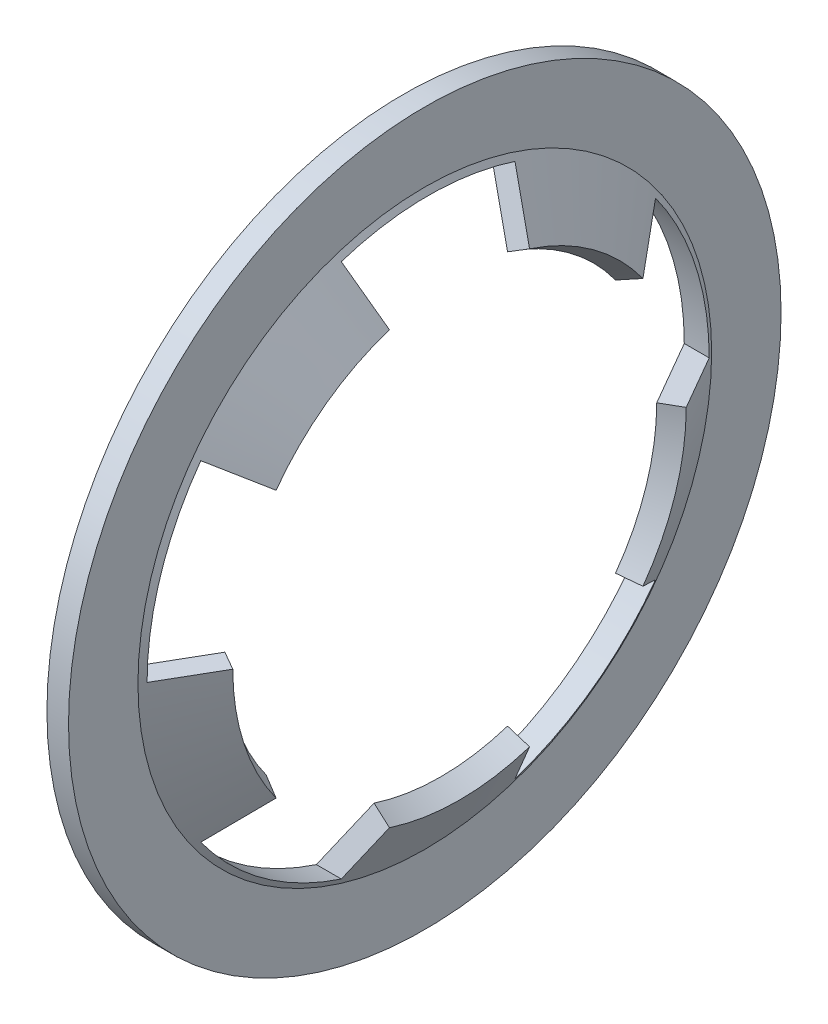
ISO-10303-21;
HEADER;
FILE_DESCRIPTION(('STEP AP214'),'2;1');
FILE_NAME('part.step','',(''),(''),'','','');
FILE_SCHEMA(('AUTOMOTIVE_DESIGN { 1 0 10303 214 1 1 1 1 }'));
ENDSEC;
DATA;
#1=APPLICATION_CONTEXT('core data for automotive mechanical design processes');
#2=APPLICATION_PROTOCOL_DEFINITION('international standard','automotive_design',2000,#1);
#3=PRODUCT_CONTEXT('',#1,'mechanical');
#4=PRODUCT('Part','Part','',(#3));
#5=PRODUCT_RELATED_PRODUCT_CATEGORY('part','',(#4));
#6=PRODUCT_DEFINITION_FORMATION('','',#4);
#7=PRODUCT_DEFINITION_CONTEXT('part definition',#1,'design');
#8=PRODUCT_DEFINITION('design','',#6,#7);
#9=PRODUCT_DEFINITION_SHAPE('','',#8);
#10=(LENGTH_UNIT() NAMED_UNIT(*) SI_UNIT(.MILLI.,.METRE.));
#11=(NAMED_UNIT(*) PLANE_ANGLE_UNIT() SI_UNIT($,.RADIAN.));
#12=(NAMED_UNIT(*) SI_UNIT($,.STERADIAN.) SOLID_ANGLE_UNIT());
#13=UNCERTAINTY_MEASURE_WITH_UNIT(LENGTH_MEASURE(1.E-05),#10,'distance_accuracy_value','');
#14=(GEOMETRIC_REPRESENTATION_CONTEXT(3) GLOBAL_UNCERTAINTY_ASSIGNED_CONTEXT((#13)) GLOBAL_UNIT_ASSIGNED_CONTEXT((#10,
#11,#12)) REPRESENTATION_CONTEXT('',''));
#15=CARTESIAN_POINT('',(0.,0.,0.));
#16=DIRECTION('',(0.,0.,1.));
#17=DIRECTION('',(1.,0.,0.));
#18=AXIS2_PLACEMENT_3D('',#15,#16,#17);
#19=CARTESIAN_POINT('',(1.04307806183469,0.,0.));
#20=DIRECTION('',(-0.999999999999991,0.,0.));
#21=DIRECTION('',(0.,0.,1.));
#22=AXIS2_PLACEMENT_3D('',#19,#20,#21);
#23=CONICAL_SURFACE('',#22,4.2,1.0471975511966);
#24=CARTESIAN_POINT('',(0.400000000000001,0.,0.));
#25=DIRECTION('',(-0.999999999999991,0.,0.));
#26=DIRECTION('',(0.,0.,1.));
#27=AXIS2_PLACEMENT_3D('',#24,#25,#26);
#28=CIRCLE('',#27,5.31384387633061);
#29=CARTESIAN_POINT('',(0.400000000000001,0.,5.31384387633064));
#30=VERTEX_POINT('',#29);
#31=EDGE_CURVE('E11',#30,#30,#28,.T.);
#32=ORIENTED_EDGE('',*,*,#31,.F.);
#33=EDGE_LOOP('',(#32));
#34=FACE_BOUND('',#33,.T.);
#35=DIRECTION('',(-0.499999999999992,0.82363910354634,-0.267616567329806));
#36=VECTOR('',#35,1.);
#37=CARTESIAN_POINT('',(3.46794919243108,0.,0.));
#38=LINE('',#37,#36);
#39=CARTESIAN_POINT('',(1.04307806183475,3.9944373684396,-1.29787137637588));
#40=VERTEX_POINT('',#39);
#41=CARTESIAN_POINT('',(0.461880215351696,4.95183191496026,-1.60894772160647));
#42=VERTEX_POINT('',#41);
#43=EDGE_CURVE('E344',#40,#42,#38,.T.);
#44=ORIENTED_EDGE('',*,*,#43,.F.);
#45=CARTESIAN_POINT('',(1.04307806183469,0.,0.));
#46=DIRECTION('',(-0.999999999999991,0.,0.));
#47=DIRECTION('',(0.,0.,1.));
#48=AXIS2_PLACEMENT_3D('',#45,#46,#47);
#49=CIRCLE('',#48,4.2);
#50=CARTESIAN_POINT('',(1.04307806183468,2.46869805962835,-3.39787137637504));
#51=VERTEX_POINT('',#50);
#52=EDGE_CURVE('E191',#40,#51,#49,.T.);
#53=ORIENTED_EDGE('',*,*,#52,.T.);
#54=DIRECTION('',(0.499999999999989,-0.509036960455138,0.700629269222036));
#55=VECTOR('',#54,1.);
#56=CARTESIAN_POINT('',(3.46794919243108,0.,0.));
#57=LINE('',#56,#55);
#58=CARTESIAN_POINT('',(0.461880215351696,3.06040043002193,-4.2122798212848));
#59=VERTEX_POINT('',#58);
#60=EDGE_CURVE('E336',#59,#51,#57,.T.);
#61=ORIENTED_EDGE('',*,*,#60,.F.);
#62=CARTESIAN_POINT('',(0.4618802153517,0.,0.));
#63=DIRECTION('',(-0.999999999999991,0.,0.));
#64=DIRECTION('',(0.,0.587785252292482,-0.809016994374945));
#65=AXIS2_PLACEMENT_3D('',#62,#63,#64);
#66=CIRCLE('',#65,5.20666419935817);
#67=CARTESIAN_POINT('',(0.461880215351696,0.,-5.20666419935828));
#68=VERTEX_POINT('',#67);
#69=EDGE_CURVE('E326',#68,#59,#66,.F.);
#70=ORIENTED_EDGE('',*,*,#69,.F.);
#71=DIRECTION('',(-0.49999999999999,0.,-0.866025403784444));
#72=VECTOR('',#71,1.);
#73=CARTESIAN_POINT('',(3.46794919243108,0.,0.));
#74=LINE('',#73,#72);
#75=CARTESIAN_POINT('',(1.04307806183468,0.,-4.19999999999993));
#76=VERTEX_POINT('',#75);
#77=EDGE_CURVE('E318',#76,#68,#74,.T.);
#78=ORIENTED_EDGE('',*,*,#77,.F.);
#79=CARTESIAN_POINT('',(1.04307806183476,-2.4686980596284,-3.39787137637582));
#80=VERTEX_POINT('',#79);
#81=EDGE_CURVE('E193',#76,#80,#49,.T.);
#82=ORIENTED_EDGE('',*,*,#81,.T.);
#83=DIRECTION('',(0.49999999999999,0.509036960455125,0.700629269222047));
#84=VECTOR('',#83,1.);
#85=CARTESIAN_POINT('',(3.46794919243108,0.,0.));
#86=LINE('',#85,#84);
#87=CARTESIAN_POINT('',(0.461880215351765,-3.06040043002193,-4.21227982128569));
#88=VERTEX_POINT('',#87);
#89=EDGE_CURVE('E310',#88,#80,#86,.T.);
#90=ORIENTED_EDGE('',*,*,#89,.F.);
#91=CARTESIAN_POINT('',(0.4618802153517,0.,0.));
#92=DIRECTION('',(-0.999999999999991,0.,0.));
#93=DIRECTION('',(0.,-0.58778525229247,-0.809016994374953));
#94=AXIS2_PLACEMENT_3D('',#91,#92,#93);
#95=CIRCLE('',#94,5.20666419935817);
#96=CARTESIAN_POINT('',(0.461880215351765,-4.95183191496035,-1.60894772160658));
#97=VERTEX_POINT('',#96);
#98=EDGE_CURVE('E300',#97,#88,#95,.F.);
#99=ORIENTED_EDGE('',*,*,#98,.F.);
#100=DIRECTION('',(-0.49999999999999,-0.823639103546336,-0.267616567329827));
#101=VECTOR('',#100,1.);
#102=CARTESIAN_POINT('',(3.46794919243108,0.,0.));
#103=LINE('',#102,#101);
#104=CARTESIAN_POINT('',(1.04307806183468,-3.99443736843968,-1.29787137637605));
#105=VERTEX_POINT('',#104);
#106=EDGE_CURVE('E292',#105,#97,#103,.T.);
#107=ORIENTED_EDGE('',*,*,#106,.F.);
#108=CARTESIAN_POINT('',(1.04307806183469,-3.99443736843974,1.29787137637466));
#109=VERTEX_POINT('',#108);
#110=EDGE_CURVE('E195',#105,#109,#49,.T.);
#111=ORIENTED_EDGE('',*,*,#110,.T.);
#112=DIRECTION('',(0.499999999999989,0.823639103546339,-0.267616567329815));
#113=VECTOR('',#112,1.);
#114=CARTESIAN_POINT('',(3.46794919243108,0.,0.));
#115=LINE('',#114,#113);
#116=CARTESIAN_POINT('',(0.4618802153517,-4.95183191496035,1.60894772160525));
#117=VERTEX_POINT('',#116);
#118=EDGE_CURVE('E284',#117,#109,#115,.T.);
#119=ORIENTED_EDGE('',*,*,#118,.F.);
#120=CARTESIAN_POINT('',(0.4618802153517,0.,0.));
#121=DIRECTION('',(-0.999999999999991,0.,0.));
#122=DIRECTION('',(0.,-0.951056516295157,0.309016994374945));
#123=AXIS2_PLACEMENT_3D('',#120,#121,#122);
#124=CIRCLE('',#123,5.20666419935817);
#125=CARTESIAN_POINT('',(0.461880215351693,-3.06040043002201,4.21227982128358));
#126=VERTEX_POINT('',#125);
#127=EDGE_CURVE('E274',#126,#117,#124,.F.);
#128=ORIENTED_EDGE('',*,*,#127,.F.);
#129=DIRECTION('',(-0.499999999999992,-0.509036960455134,0.700629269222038));
#130=VECTOR('',#129,1.);
#131=CARTESIAN_POINT('',(3.46794919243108,0.,0.));
#132=LINE('',#131,#130);
#133=CARTESIAN_POINT('',(1.04307806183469,-2.46869805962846,3.39787137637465));
#134=VERTEX_POINT('',#133);
#135=EDGE_CURVE('E266',#134,#126,#132,.T.);
#136=ORIENTED_EDGE('',*,*,#135,.F.);
#137=CARTESIAN_POINT('',(1.04307806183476,-1.11022302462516E-13,4.19999999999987));
#138=VERTEX_POINT('',#137);
#139=EDGE_CURVE('E192',#134,#138,#49,.T.);
#140=ORIENTED_EDGE('',*,*,#139,.T.);
#141=DIRECTION('',(0.49999999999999,0.,-0.866025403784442));
#142=VECTOR('',#141,1.);
#143=CARTESIAN_POINT('',(3.46794919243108,0.,0.));
#144=LINE('',#143,#142);
#145=CARTESIAN_POINT('',(0.461880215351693,0.,5.20666419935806));
#146=VERTEX_POINT('',#145);
#147=EDGE_CURVE('E252',#146,#138,#144,.T.);
#148=ORIENTED_EDGE('',*,*,#147,.F.);
#149=CARTESIAN_POINT('',(0.4618802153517,0.,0.));
#150=DIRECTION('',(-0.999999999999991,0.,0.));
#151=DIRECTION('',(0.,0.,1.));
#152=AXIS2_PLACEMENT_3D('',#149,#150,#151);
#153=CIRCLE('',#152,5.20666419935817);
#154=CARTESIAN_POINT('',(0.461880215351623,3.06040043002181,4.21227982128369));
#155=VERTEX_POINT('',#154);
#156=EDGE_CURVE('E250',#155,#146,#153,.F.);
#157=ORIENTED_EDGE('',*,*,#156,.F.);
#158=DIRECTION('',(-0.49999999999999,0.509036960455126,0.700629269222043));
#159=VECTOR('',#158,1.);
#160=CARTESIAN_POINT('',(3.46794919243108,0.,0.));
#161=LINE('',#160,#159);
#162=CARTESIAN_POINT('',(1.04307806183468,2.46869805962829,3.3978713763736));
#163=VERTEX_POINT('',#162);
#164=EDGE_CURVE('E190',#163,#155,#161,.T.);
#165=ORIENTED_EDGE('',*,*,#164,.F.);
#166=CARTESIAN_POINT('',(1.04307806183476,3.99443736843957,1.29787137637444));
#167=VERTEX_POINT('',#166);
#168=EDGE_CURVE('E39',#163,#167,#49,.T.);
#169=ORIENTED_EDGE('',*,*,#168,.T.);
#170=DIRECTION('',(0.49999999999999,-0.823639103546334,-0.26761656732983));
#171=VECTOR('',#170,1.);
#172=CARTESIAN_POINT('',(3.46794919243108,0.,0.));
#173=LINE('',#172,#171);
#174=CARTESIAN_POINT('',(0.461880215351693,4.95183191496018,1.60894772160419));
#175=VERTEX_POINT('',#174);
#176=EDGE_CURVE('E169',#175,#167,#173,.T.);
#177=ORIENTED_EDGE('',*,*,#176,.F.);
#178=CARTESIAN_POINT('',(0.4618802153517,0.,0.));
#179=DIRECTION('',(-0.999999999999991,0.,0.));
#180=DIRECTION('',(0.,0.95105651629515,0.309016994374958));
#181=AXIS2_PLACEMENT_3D('',#178,#179,#180);
#182=CIRCLE('',#181,5.20666419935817);
#183=EDGE_CURVE('E352',#42,#175,#182,.F.);
#184=ORIENTED_EDGE('',*,*,#183,.F.);
#185=EDGE_LOOP('',(#44,#53,#61,#70,#78,#82,#90,#99,#107,#111,#119,#128,#136,#140,#148,#157,#165,
#169,#177,#184));
#186=FACE_BOUND('',#185,.T.);
#187=ADVANCED_FACE('F31',(#34,#186),#23,.T.);
#188=CARTESIAN_POINT('',(1.04307806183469,0.,0.));
#189=DIRECTION('',(0.999999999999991,0.,0.));
#190=DIRECTION('',(0.,0.,-1.));
#191=AXIS2_PLACEMENT_3D('',#188,#189,#190);
#192=CONICAL_SURFACE('',#191,4.2,0.523598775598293);
#193=ORIENTED_EDGE('',*,*,#52,.F.);
#194=DIRECTION('',(-0.866025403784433,-0.475528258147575,0.154508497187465));
#195=VECTOR('',#194,1.);
#196=CARTESIAN_POINT('',(-6.23153532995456,-2.77555756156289E-13,-1.83186799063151E-12));
#197=LINE('',#196,#195);
#198=CARTESIAN_POINT('',(0.696667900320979,3.80422606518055,-1.23606797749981));
#199=VERTEX_POINT('',#198);
#200=EDGE_CURVE('E339',#40,#199,#197,.T.);
#201=ORIENTED_EDGE('',*,*,#200,.T.);
#202=CARTESIAN_POINT('',(0.69666790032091,0.,0.));
#203=DIRECTION('',(-0.999999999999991,0.,0.));
#204=DIRECTION('',(0.,0.,1.));
#205=AXIS2_PLACEMENT_3D('',#202,#203,#204);
#206=CIRCLE('',#205,4.);
#207=CARTESIAN_POINT('',(0.696667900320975,2.35114100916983,-3.23606797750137));
#208=VERTEX_POINT('',#207);
#209=EDGE_CURVE('E200',#199,#208,#206,.T.);
#210=ORIENTED_EDGE('',*,*,#209,.T.);
#211=DIRECTION('',(0.866025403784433,0.29389262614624,-0.404508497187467));
#212=VECTOR('',#211,1.);
#213=CARTESIAN_POINT('',(-6.23153532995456,-3.88578058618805E-13,-2.16493489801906E-12));
#214=LINE('',#213,#212);
#215=EDGE_CURVE('E333',#208,#51,#214,.T.);
#216=ORIENTED_EDGE('',*,*,#215,.T.);
#217=EDGE_LOOP('',(#193,#201,#210,#216));
#218=FACE_BOUND('',#217,.T.);
#219=ADVANCED_FACE('F371',(#218),#192,.F.);
#220=CARTESIAN_POINT('',(0.69666790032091,2.3511410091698,3.23606797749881));
#221=VERTEX_POINT('',#220);
#222=CARTESIAN_POINT('',(0.69666790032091,3.80422606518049,1.23606797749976));
#223=VERTEX_POINT('',#222);
#224=EDGE_CURVE('E184',#221,#223,#206,.T.);
#225=ORIENTED_EDGE('',*,*,#224,.T.);
#226=DIRECTION('',(0.866025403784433,0.475528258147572,0.15450849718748));
#227=VECTOR('',#226,1.);
#228=CARTESIAN_POINT('',(-6.23153532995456,-2.77555756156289E-13,-1.83186799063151E-12));
#229=LINE('',#228,#227);
#230=EDGE_CURVE('E172',#223,#167,#229,.T.);
#231=ORIENTED_EDGE('',*,*,#230,.T.);
#232=ORIENTED_EDGE('',*,*,#168,.F.);
#233=DIRECTION('',(-0.866025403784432,-0.293892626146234,-0.404508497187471));
#234=VECTOR('',#233,1.);
#235=CARTESIAN_POINT('',(-6.23153532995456,-2.77555756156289E-13,-1.83186799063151E-12));
#236=LINE('',#235,#234);
#237=EDGE_CURVE('E246',#163,#221,#236,.T.);
#238=ORIENTED_EDGE('',*,*,#237,.T.);
#239=EDGE_LOOP('',(#225,#231,#232,#238));
#240=FACE_BOUND('',#239,.T.);
#241=ADVANCED_FACE('F181',(#240),#192,.F.);
#242=CARTESIAN_POINT('',(0.69666790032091,0.,0.));
#243=DIRECTION('',(-0.999999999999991,0.,0.));
#244=DIRECTION('',(0.,0.,1.));
#245=AXIS2_PLACEMENT_3D('',#242,#243,#244);
#246=CONICAL_SURFACE('',#245,4.,1.0471975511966);
#247=ORIENTED_EDGE('',*,*,#209,.F.);
#248=DIRECTION('',(-0.499999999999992,0.82363910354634,-0.267616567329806));
#249=VECTOR('',#248,1.);
#250=CARTESIAN_POINT('',(3.00606897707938,-1.66533453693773E-13,-1.11022302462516E-13));
#251=LINE('',#250,#249);
#252=CARTESIAN_POINT('',(0.,4.95183191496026,-1.60894772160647));
#253=VERTEX_POINT('',#252);
#254=EDGE_CURVE('E342',#199,#253,#251,.T.);
#255=ORIENTED_EDGE('',*,*,#254,.T.);
#256=CARTESIAN_POINT('',(0.,0.,0.));
#257=DIRECTION('',(-0.999999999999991,0.,0.));
#258=DIRECTION('',(0.,0.,1.));
#259=AXIS2_PLACEMENT_3D('',#256,#257,#258);
#260=CIRCLE('',#259,5.20666419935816);
#261=CARTESIAN_POINT('',(0.,3.06040043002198,-4.21227982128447));
#262=VERTEX_POINT('',#261);
#263=EDGE_CURVE('E54',#253,#262,#260,.T.);
#264=ORIENTED_EDGE('',*,*,#263,.T.);
#265=DIRECTION('',(0.499999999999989,-0.509036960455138,0.700629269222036));
#266=VECTOR('',#265,1.);
#267=CARTESIAN_POINT('',(3.00606897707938,-1.66533453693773E-13,-1.11022302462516E-13));
#268=LINE('',#267,#266);
#269=EDGE_CURVE('E331',#262,#208,#268,.T.);
#270=ORIENTED_EDGE('',*,*,#269,.T.);
#271=EDGE_LOOP('',(#247,#255,#264,#270));
#272=FACE_BOUND('',#271,.T.);
#273=ADVANCED_FACE('F366',(#272),#246,.F.);
#274=CARTESIAN_POINT('',(0.,3.0604004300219,4.21227982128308));
#275=VERTEX_POINT('',#274);
#276=CARTESIAN_POINT('',(0.,4.95183191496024,1.60894772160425));
#277=VERTEX_POINT('',#276);
#278=EDGE_CURVE('E212',#275,#277,#260,.T.);
#279=ORIENTED_EDGE('',*,*,#278,.T.);
#280=DIRECTION('',(0.49999999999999,-0.823639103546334,-0.26761656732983));
#281=VECTOR('',#280,1.);
#282=CARTESIAN_POINT('',(3.00606897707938,-1.66533453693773E-13,-1.11022302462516E-13));
#283=LINE('',#282,#281);
#284=EDGE_CURVE('E185',#277,#223,#283,.T.);
#285=ORIENTED_EDGE('',*,*,#284,.T.);
#286=ORIENTED_EDGE('',*,*,#224,.F.);
#287=DIRECTION('',(-0.49999999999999,0.509036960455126,0.700629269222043));
#288=VECTOR('',#287,1.);
#289=CARTESIAN_POINT('',(3.00606897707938,-1.66533453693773E-13,-1.11022302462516E-13));
#290=LINE('',#289,#288);
#291=EDGE_CURVE('E248',#221,#275,#290,.T.);
#292=ORIENTED_EDGE('',*,*,#291,.T.);
#293=EDGE_LOOP('',(#279,#285,#286,#292));
#294=FACE_BOUND('',#293,.T.);
#295=ADVANCED_FACE('F356',(#294),#246,.F.);
#296=ORIENTED_EDGE('',*,*,#81,.F.);
#297=DIRECTION('',(-0.866025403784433,0.,0.499999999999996));
#298=VECTOR('',#297,1.);
#299=CARTESIAN_POINT('',(-6.23153532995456,-2.77555756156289E-13,-1.83186799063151E-12));
#300=LINE('',#299,#298);
#301=CARTESIAN_POINT('',(0.696667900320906,0.,-4.00000000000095));
#302=VERTEX_POINT('',#301);
#303=EDGE_CURVE('E313',#76,#302,#300,.T.);
#304=ORIENTED_EDGE('',*,*,#303,.T.);
#305=CARTESIAN_POINT('',(0.696667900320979,-2.35114100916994,-3.23606797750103));
#306=VERTEX_POINT('',#305);
#307=EDGE_CURVE('E202',#302,#306,#206,.T.);
#308=ORIENTED_EDGE('',*,*,#307,.T.);
#309=DIRECTION('',(0.866025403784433,-0.293892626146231,-0.404508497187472));
#310=VECTOR('',#309,1.);
#311=CARTESIAN_POINT('',(-6.23153532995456,-3.88578058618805E-13,-2.16493489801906E-12));
#312=LINE('',#311,#310);
#313=EDGE_CURVE('E307',#306,#80,#312,.T.);
#314=ORIENTED_EDGE('',*,*,#313,.T.);
#315=EDGE_LOOP('',(#296,#304,#308,#314));
#316=FACE_BOUND('',#315,.T.);
#317=ADVANCED_FACE('F384',(#316),#192,.F.);
#318=ORIENTED_EDGE('',*,*,#307,.F.);
#319=DIRECTION('',(-0.49999999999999,0.,-0.866025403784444));
#320=VECTOR('',#319,1.);
#321=CARTESIAN_POINT('',(3.00606897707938,-1.66533453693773E-13,-1.11022302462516E-13));
#322=LINE('',#321,#320);
#323=CARTESIAN_POINT('',(0.,0.,-5.20666419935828));
#324=VERTEX_POINT('',#323);
#325=EDGE_CURVE('E316',#302,#324,#322,.T.);
#326=ORIENTED_EDGE('',*,*,#325,.T.);
#327=CARTESIAN_POINT('',(0.,-3.06040043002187,-4.21227982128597));
#328=VERTEX_POINT('',#327);
#329=EDGE_CURVE('E221',#324,#328,#260,.T.);
#330=ORIENTED_EDGE('',*,*,#329,.T.);
#331=DIRECTION('',(0.49999999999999,0.509036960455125,0.700629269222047));
#332=VECTOR('',#331,1.);
#333=CARTESIAN_POINT('',(3.00606897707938,-1.66533453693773E-13,-1.11022302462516E-13));
#334=LINE('',#333,#332);
#335=EDGE_CURVE('E305',#328,#306,#334,.T.);
#336=ORIENTED_EDGE('',*,*,#335,.T.);
#337=EDGE_LOOP('',(#318,#326,#330,#336));
#338=FACE_BOUND('',#337,.T.);
#339=ADVANCED_FACE('F386',(#338),#246,.F.);
#340=ORIENTED_EDGE('',*,*,#110,.F.);
#341=DIRECTION('',(-0.866025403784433,0.475528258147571,0.154508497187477));
#342=VECTOR('',#341,1.);
#343=CARTESIAN_POINT('',(-6.23153532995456,-2.77555756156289E-13,-1.83186799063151E-12));
#344=LINE('',#343,#342);
#345=CARTESIAN_POINT('',(0.696667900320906,-3.80422606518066,-1.23606797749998));
#346=VERTEX_POINT('',#345);
#347=EDGE_CURVE('E287',#105,#346,#344,.T.);
#348=ORIENTED_EDGE('',*,*,#347,.T.);
#349=CARTESIAN_POINT('',(0.696667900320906,-3.80422606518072,1.23606797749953));
#350=VERTEX_POINT('',#349);
#351=EDGE_CURVE('E204',#346,#350,#206,.T.);
#352=ORIENTED_EDGE('',*,*,#351,.T.);
#353=DIRECTION('',(0.866025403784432,-0.475528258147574,0.15450849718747));
#354=VECTOR('',#353,1.);
#355=CARTESIAN_POINT('',(-6.23153532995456,-2.77555756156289E-13,-1.83186799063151E-12));
#356=LINE('',#355,#354);
#357=EDGE_CURVE('E281',#350,#109,#356,.T.);
#358=ORIENTED_EDGE('',*,*,#357,.T.);
#359=EDGE_LOOP('',(#340,#348,#352,#358));
#360=FACE_BOUND('',#359,.T.);
#361=ADVANCED_FACE('F404',(#360),#192,.F.);
#362=ORIENTED_EDGE('',*,*,#351,.F.);
#363=DIRECTION('',(-0.49999999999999,-0.823639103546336,-0.267616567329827));
#364=VECTOR('',#363,1.);
#365=CARTESIAN_POINT('',(3.00606897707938,-1.66533453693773E-13,-1.11022302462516E-13));
#366=LINE('',#365,#364);
#367=CARTESIAN_POINT('',(0.,-4.95183191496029,-1.60894772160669));
#368=VERTEX_POINT('',#367);
#369=EDGE_CURVE('E290',#346,#368,#366,.T.);
#370=ORIENTED_EDGE('',*,*,#369,.T.);
#371=CARTESIAN_POINT('',(0.,-4.95183191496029,1.60894772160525));
#372=VERTEX_POINT('',#371);
#373=EDGE_CURVE('E222',#368,#372,#260,.T.);
#374=ORIENTED_EDGE('',*,*,#373,.T.);
#375=DIRECTION('',(0.499999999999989,0.823639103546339,-0.267616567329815));
#376=VECTOR('',#375,1.);
#377=CARTESIAN_POINT('',(3.00606897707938,-1.66533453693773E-13,-1.11022302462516E-13));
#378=LINE('',#377,#376);
#379=EDGE_CURVE('E279',#372,#350,#378,.T.);
#380=ORIENTED_EDGE('',*,*,#379,.T.);
#381=EDGE_LOOP('',(#362,#370,#374,#380));
#382=FACE_BOUND('',#381,.T.);
#383=ADVANCED_FACE('F399',(#382),#246,.F.);
#384=ORIENTED_EDGE('',*,*,#139,.F.);
#385=DIRECTION('',(-0.866025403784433,0.293892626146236,-0.404508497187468));
#386=VECTOR('',#385,1.);
#387=CARTESIAN_POINT('',(-6.23153532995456,-2.77555756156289E-13,-1.83186799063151E-12));
#388=LINE('',#387,#386);
#389=CARTESIAN_POINT('',(0.69666790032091,-2.35114100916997,3.23606797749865));
#390=VERTEX_POINT('',#389);
#391=EDGE_CURVE('E262',#134,#390,#388,.T.);
#392=ORIENTED_EDGE('',*,*,#391,.T.);
#393=CARTESIAN_POINT('',(0.696667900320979,-1.11022302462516E-13,3.99999999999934));
#394=VERTEX_POINT('',#393);
#395=EDGE_CURVE('E201',#390,#394,#206,.T.);
#396=ORIENTED_EDGE('',*,*,#395,.T.);
#397=DIRECTION('',(0.866025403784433,0.,0.499999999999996));
#398=VECTOR('',#397,1.);
#399=CARTESIAN_POINT('',(-6.23153532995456,-2.77555756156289E-13,-1.83186799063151E-12));
#400=LINE('',#399,#398);
#401=EDGE_CURVE('E254',#394,#138,#400,.T.);
#402=ORIENTED_EDGE('',*,*,#401,.T.);
#403=EDGE_LOOP('',(#384,#392,#396,#402));
#404=FACE_BOUND('',#403,.T.);
#405=ADVANCED_FACE('F414',(#404),#192,.F.);
#406=ORIENTED_EDGE('',*,*,#395,.F.);
#407=DIRECTION('',(-0.499999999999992,-0.509036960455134,0.700629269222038));
#408=VECTOR('',#407,1.);
#409=CARTESIAN_POINT('',(3.00606897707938,-1.66533453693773E-13,-1.11022302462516E-13));
#410=LINE('',#409,#408);
#411=CARTESIAN_POINT('',(0.,-3.06040043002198,4.21227982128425));
#412=VERTEX_POINT('',#411);
#413=EDGE_CURVE('E264',#390,#412,#410,.T.);
#414=ORIENTED_EDGE('',*,*,#413,.T.);
#415=CARTESIAN_POINT('',(0.,-1.11022302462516E-13,5.20666419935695));
#416=VERTEX_POINT('',#415);
#417=EDGE_CURVE('E219',#412,#416,#260,.T.);
#418=ORIENTED_EDGE('',*,*,#417,.T.);
#419=DIRECTION('',(0.49999999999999,0.,-0.866025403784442));
#420=VECTOR('',#419,1.);
#421=CARTESIAN_POINT('',(3.00606897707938,-1.66533453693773E-13,-1.11022302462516E-13));
#422=LINE('',#421,#420);
#423=EDGE_CURVE('E256',#416,#394,#422,.T.);
#424=ORIENTED_EDGE('',*,*,#423,.T.);
#425=EDGE_LOOP('',(#406,#414,#418,#424));
#426=FACE_BOUND('',#425,.T.);
#427=ADVANCED_FACE('F415',(#426),#246,.F.);
#428=CARTESIAN_POINT('',(0.400000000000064,5.20666419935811,-4.44089209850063E-13));
#429=DIRECTION('',(-0.999999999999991,0.,0.));
#430=DIRECTION('',(0.,0.,1.));
#431=AXIS2_PLACEMENT_3D('',#428,#429,#430);
#432=PLANE('',#431);
#433=CARTESIAN_POINT('',(0.400000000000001,0.,0.));
#434=DIRECTION('',(-0.999999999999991,0.,0.));
#435=DIRECTION('',(0.,0.,1.));
#436=AXIS2_PLACEMENT_3D('',#433,#434,#435);
#437=CIRCLE('',#436,6.6);
#438=CARTESIAN_POINT('',(0.400000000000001,0.,6.60000000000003));
#439=VERTEX_POINT('',#438);
#440=EDGE_CURVE('E239',#439,#439,#437,.T.);
#441=ORIENTED_EDGE('',*,*,#440,.F.);
#442=EDGE_LOOP('',(#441));
#443=FACE_BOUND('',#442,.T.);
#444=ORIENTED_EDGE('',*,*,#31,.T.);
#445=EDGE_LOOP('',(#444));
#446=FACE_BOUND('',#445,.T.);
#447=ADVANCED_FACE('F33',(#443,#446),#432,.F.);
#448=CARTESIAN_POINT('',(0.,5.20666419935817,-1.11022302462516E-13));
#449=DIRECTION('',(-0.999999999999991,0.,0.));
#450=DIRECTION('',(0.,0.,1.));
#451=AXIS2_PLACEMENT_3D('',#448,#449,#450);
#452=PLANE('',#451);
#453=CARTESIAN_POINT('',(0.,0.,0.));
#454=DIRECTION('',(-0.999999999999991,0.,0.));
#455=DIRECTION('',(0.,0.,1.));
#456=AXIS2_PLACEMENT_3D('',#453,#454,#455);
#457=CIRCLE('',#456,6.6);
#458=CARTESIAN_POINT('',(0.,0.,6.60000000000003));
#459=VERTEX_POINT('',#458);
#460=EDGE_CURVE('E233',#459,#459,#457,.T.);
#461=ORIENTED_EDGE('',*,*,#460,.T.);
#462=EDGE_LOOP('',(#461));
#463=FACE_BOUND('',#462,.T.);
#464=EDGE_CURVE('E205',#416,#275,#260,.T.);
#465=ORIENTED_EDGE('',*,*,#464,.F.);
#466=ORIENTED_EDGE('',*,*,#417,.F.);
#467=CARTESIAN_POINT('',(0.,0.,0.));
#468=DIRECTION('',(-0.999999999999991,0.,0.));
#469=DIRECTION('',(0.,-0.951056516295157,0.309016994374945));
#470=AXIS2_PLACEMENT_3D('',#467,#468,#469);
#471=CIRCLE('',#470,5.20666419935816);
#472=EDGE_CURVE('E272',#372,#412,#471,.T.);
#473=ORIENTED_EDGE('',*,*,#472,.F.);
#474=ORIENTED_EDGE('',*,*,#373,.F.);
#475=CARTESIAN_POINT('',(0.,0.,0.));
#476=DIRECTION('',(-0.999999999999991,0.,0.));
#477=DIRECTION('',(0.,-0.58778525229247,-0.809016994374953));
#478=AXIS2_PLACEMENT_3D('',#475,#476,#477);
#479=CIRCLE('',#478,5.20666419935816);
#480=EDGE_CURVE('E298',#328,#368,#479,.T.);
#481=ORIENTED_EDGE('',*,*,#480,.F.);
#482=ORIENTED_EDGE('',*,*,#329,.F.);
#483=CARTESIAN_POINT('',(0.,0.,0.));
#484=DIRECTION('',(-0.999999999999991,0.,0.));
#485=DIRECTION('',(0.,0.587785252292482,-0.809016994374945));
#486=AXIS2_PLACEMENT_3D('',#483,#484,#485);
#487=CIRCLE('',#486,5.20666419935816);
#488=EDGE_CURVE('E324',#262,#324,#487,.T.);
#489=ORIENTED_EDGE('',*,*,#488,.F.);
#490=ORIENTED_EDGE('',*,*,#263,.F.);
#491=CARTESIAN_POINT('',(0.,0.,0.));
#492=DIRECTION('',(-0.999999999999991,0.,0.));
#493=DIRECTION('',(0.,0.95105651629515,0.309016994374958));
#494=AXIS2_PLACEMENT_3D('',#491,#492,#493);
#495=CIRCLE('',#494,5.20666419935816);
#496=EDGE_CURVE('E350',#277,#253,#495,.T.);
#497=ORIENTED_EDGE('',*,*,#496,.F.);
#498=ORIENTED_EDGE('',*,*,#278,.F.);
#499=EDGE_LOOP('',(#465,#466,#473,#474,#481,#482,#489,#490,#497,#498));
#500=FACE_BOUND('',#499,.T.);
#501=ADVANCED_FACE('F360',(#463,#500),#452,.T.);
#502=CARTESIAN_POINT('',(0.,0.,0.));
#503=DIRECTION('',(-0.999999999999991,0.,0.));
#504=DIRECTION('',(0.,0.,1.));
#505=AXIS2_PLACEMENT_3D('',#502,#503,#504);
#506=CYLINDRICAL_SURFACE('',#505,6.6);
#507=CARTESIAN_POINT('',(0.400000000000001,0.,6.60000000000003));
#508=CARTESIAN_POINT('',(0.395833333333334,0.,6.60000000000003));
#509=CARTESIAN_POINT('',(0.391666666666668,0.,6.60000000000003));
#510=CARTESIAN_POINT('',(0.383333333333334,0.,6.60000000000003));
#511=CARTESIAN_POINT('',(0.379166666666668,0.,6.60000000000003));
#512=CARTESIAN_POINT('',(0.370833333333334,0.,6.60000000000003));
#513=CARTESIAN_POINT('',(0.366666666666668,0.,6.60000000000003));
#514=CARTESIAN_POINT('',(0.358333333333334,0.,6.60000000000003));
#515=CARTESIAN_POINT('',(0.354166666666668,0.,6.60000000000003));
#516=CARTESIAN_POINT('',(0.345833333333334,0.,6.60000000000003));
#517=CARTESIAN_POINT('',(0.341666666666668,0.,6.60000000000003));
#518=CARTESIAN_POINT('',(0.333333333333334,0.,6.60000000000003));
#519=CARTESIAN_POINT('',(0.329166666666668,0.,6.60000000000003));
#520=CARTESIAN_POINT('',(0.320833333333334,0.,6.60000000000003));
#521=CARTESIAN_POINT('',(0.316666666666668,0.,6.60000000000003));
#522=CARTESIAN_POINT('',(0.308333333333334,0.,6.60000000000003));
#523=CARTESIAN_POINT('',(0.304166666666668,0.,6.60000000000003));
#524=CARTESIAN_POINT('',(0.295833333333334,0.,6.60000000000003));
#525=CARTESIAN_POINT('',(0.291666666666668,0.,6.60000000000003));
#526=CARTESIAN_POINT('',(0.283333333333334,0.,6.60000000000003));
#527=CARTESIAN_POINT('',(0.279166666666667,0.,6.60000000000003));
#528=CARTESIAN_POINT('',(0.270833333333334,0.,6.60000000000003));
#529=CARTESIAN_POINT('',(0.266666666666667,0.,6.60000000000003));
#530=CARTESIAN_POINT('',(0.258333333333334,0.,6.60000000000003));
#531=CARTESIAN_POINT('',(0.254166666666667,0.,6.60000000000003));
#532=CARTESIAN_POINT('',(0.245833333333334,0.,6.60000000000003));
#533=CARTESIAN_POINT('',(0.241666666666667,0.,6.60000000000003));
#534=CARTESIAN_POINT('',(0.233333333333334,0.,6.60000000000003));
#535=CARTESIAN_POINT('',(0.229166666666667,0.,6.60000000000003));
#536=CARTESIAN_POINT('',(0.220833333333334,0.,6.60000000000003));
#537=CARTESIAN_POINT('',(0.216666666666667,0.,6.60000000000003));
#538=CARTESIAN_POINT('',(0.208333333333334,0.,6.60000000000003));
#539=CARTESIAN_POINT('',(0.204166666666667,0.,6.60000000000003));
#540=CARTESIAN_POINT('',(0.195833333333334,0.,6.60000000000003));
#541=CARTESIAN_POINT('',(0.191666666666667,0.,6.60000000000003));
#542=CARTESIAN_POINT('',(0.183333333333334,0.,6.60000000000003));
#543=CARTESIAN_POINT('',(0.179166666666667,0.,6.60000000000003));
#544=CARTESIAN_POINT('',(0.170833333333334,0.,6.60000000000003));
#545=CARTESIAN_POINT('',(0.166666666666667,0.,6.60000000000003));
#546=CARTESIAN_POINT('',(0.158333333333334,0.,6.60000000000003));
#547=CARTESIAN_POINT('',(0.154166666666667,0.,6.60000000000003));
#548=CARTESIAN_POINT('',(0.145833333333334,0.,6.60000000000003));
#549=CARTESIAN_POINT('',(0.141666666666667,0.,6.60000000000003));
#550=CARTESIAN_POINT('',(0.133333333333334,0.,6.60000000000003));
#551=CARTESIAN_POINT('',(0.129166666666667,0.,6.60000000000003));
#552=CARTESIAN_POINT('',(0.120833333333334,0.,6.60000000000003));
#553=CARTESIAN_POINT('',(0.116666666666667,0.,6.60000000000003));
#554=CARTESIAN_POINT('',(0.108333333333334,0.,6.60000000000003));
#555=CARTESIAN_POINT('',(0.104166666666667,0.,6.60000000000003));
#556=CARTESIAN_POINT('',(0.0958333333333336,0.,6.60000000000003));
#557=CARTESIAN_POINT('',(0.0916666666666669,0.,6.60000000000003));
#558=CARTESIAN_POINT('',(0.0833333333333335,0.,6.60000000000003));
#559=CARTESIAN_POINT('',(0.0791666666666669,0.,6.60000000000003));
#560=CARTESIAN_POINT('',(0.0708333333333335,0.,6.60000000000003));
#561=CARTESIAN_POINT('',(0.0666666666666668,0.,6.60000000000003));
#562=CARTESIAN_POINT('',(0.0583333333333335,0.,6.60000000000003));
#563=CARTESIAN_POINT('',(0.0541666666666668,0.,6.60000000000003));
#564=CARTESIAN_POINT('',(0.0458333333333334,0.,6.60000000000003));
#565=CARTESIAN_POINT('',(0.0416666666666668,0.,6.60000000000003));
#566=CARTESIAN_POINT('',(0.0333333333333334,0.,6.60000000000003));
#567=CARTESIAN_POINT('',(0.0291666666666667,0.,6.60000000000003));
#568=CARTESIAN_POINT('',(0.0208333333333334,0.,6.60000000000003));
#569=CARTESIAN_POINT('',(0.0166666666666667,0.,6.60000000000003));
#570=CARTESIAN_POINT('',(0.00833333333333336,0.,6.60000000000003));
#571=CARTESIAN_POINT('',(0.00416666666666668,0.,6.60000000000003));
#572=CARTESIAN_POINT('',(0.,0.,6.60000000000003));
#573=B_SPLINE_CURVE_WITH_KNOTS('',3,(#507,#508,#509,#510,#511,#512,#513,#514,#515,#516,#517,
#518,#519,#520,#521,#522,#523,#524,#525,#526,#527,#528,#529,#530,#531,#532,#533,#534,#535,#536,
#537,#538,#539,#540,#541,#542,#543,#544,#545,#546,#547,#548,#549,#550,#551,#552,#553,#554,#555,
#556,#557,#558,#559,#560,#561,#562,#563,#564,#565,#566,#567,#568,#569,#570,#571,#572),
.UNSPECIFIED.,.F.,.F.,(4,2,2,2,2,2,2,2,2,2,2,2,2,2,2,2,2,2,2,2,2,2,2,2,2,2,2,2,2,2,2,2,4),(0.,
0.0125,0.025,0.0375,0.0500000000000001,0.0625000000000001,0.0750000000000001,0.0875000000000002,
0.1,0.1125,0.125,0.1375,0.15,0.1625,0.175,0.1875,0.200000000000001,0.212500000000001,
0.225000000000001,0.237500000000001,0.250000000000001,0.262500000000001,0.275000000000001,
0.287500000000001,0.300000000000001,0.312500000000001,0.325000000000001,0.337500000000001,
0.350000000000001,0.362500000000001,0.375000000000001,0.387500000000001,0.400000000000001),.UNSPECIFIED.);
#574=EDGE_CURVE('BSEAM424',#439,#459,#573,.T.);
#575=ORIENTED_EDGE('',*,*,#440,.T.);
#576=ORIENTED_EDGE('',*,*,#460,.F.);
#577=ORIENTED_EDGE('',*,*,#574,.T.);
#578=ORIENTED_EDGE('',*,*,#574,.F.);
#579=EDGE_LOOP('',(#575,#577,#576,#578));
#580=FACE_BOUND('',#579,.T.);
#581=ADVANCED_FACE('F424',(#580),#506,.T.);
#582=CARTESIAN_POINT('',(1.04307806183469,2.3511410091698,3.23606797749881));
#583=DIRECTION('',(0.,-0.809016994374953,0.587785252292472));
#584=DIRECTION('',(0.,-0.587785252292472,-0.809016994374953));
#585=AXIS2_PLACEMENT_3D('',#582,#583,#584);
#586=PLANE('',#585);
#587=ORIENTED_EDGE('',*,*,#164,.T.);
#588=DIRECTION('',(-0.999999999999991,0.,0.));
#589=VECTOR('',#588,1.);
#590=CARTESIAN_POINT('',(1.04307806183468,3.0604004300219,4.21227982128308));
#591=LINE('',#590,#589);
#592=EDGE_CURVE('E258',#155,#275,#591,.T.);
#593=ORIENTED_EDGE('',*,*,#592,.T.);
#594=ORIENTED_EDGE('',*,*,#291,.F.);
#595=ORIENTED_EDGE('',*,*,#237,.F.);
#596=EDGE_LOOP('',(#587,#593,#594,#595));
#597=FACE_BOUND('',#596,.T.);
#598=ADVANCED_FACE('F422',(#597),#586,.T.);
#599=CARTESIAN_POINT('',(1.04307806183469,0.,0.));
#600=DIRECTION('',(-0.999999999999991,0.,0.));
#601=DIRECTION('',(0.,0.,1.));
#602=AXIS2_PLACEMENT_3D('',#599,#600,#601);
#603=CYLINDRICAL_SURFACE('',#602,5.20666419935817);
#604=ORIENTED_EDGE('',*,*,#156,.T.);
#605=DIRECTION('',(-0.999999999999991,0.,0.));
#606=VECTOR('',#605,1.);
#607=CARTESIAN_POINT('',(1.04307806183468,0.,5.20666419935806));
#608=LINE('',#607,#606);
#609=EDGE_CURVE('E260',#146,#416,#608,.T.);
#610=ORIENTED_EDGE('',*,*,#609,.T.);
#611=ORIENTED_EDGE('',*,*,#464,.T.);
#612=ORIENTED_EDGE('',*,*,#592,.F.);
#613=EDGE_LOOP('',(#604,#610,#611,#612));
#614=FACE_BOUND('',#613,.T.);
#615=ADVANCED_FACE('F420',(#614),#603,.F.);
#616=CARTESIAN_POINT('',(1.04307806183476,-1.11022302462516E-13,3.99999999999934));
#617=DIRECTION('',(0.,1.,0.));
#618=DIRECTION('',(0.,0.,1.));
#619=AXIS2_PLACEMENT_3D('',#616,#617,#618);
#620=PLANE('',#619);
#621=ORIENTED_EDGE('',*,*,#147,.T.);
#622=ORIENTED_EDGE('',*,*,#401,.F.);
#623=ORIENTED_EDGE('',*,*,#423,.F.);
#624=ORIENTED_EDGE('',*,*,#609,.F.);
#625=EDGE_LOOP('',(#621,#622,#623,#624));
#626=FACE_BOUND('',#625,.T.);
#627=ADVANCED_FACE('F419',(#626),#620,.T.);
#628=CARTESIAN_POINT('',(1.04307806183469,-2.35114100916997,3.23606797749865));
#629=DIRECTION('',(0.,-0.809016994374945,-0.58778525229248));
#630=DIRECTION('',(0.,0.58778525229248,-0.809016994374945));
#631=AXIS2_PLACEMENT_3D('',#628,#629,#630);
#632=PLANE('',#631);
#633=ORIENTED_EDGE('',*,*,#135,.T.);
#634=DIRECTION('',(-0.999999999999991,0.,0.));
#635=VECTOR('',#634,1.);
#636=CARTESIAN_POINT('',(1.04307806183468,-3.06040043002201,4.21227982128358));
#637=LINE('',#636,#635);
#638=EDGE_CURVE('E269',#126,#412,#637,.T.);
#639=ORIENTED_EDGE('',*,*,#638,.T.);
#640=ORIENTED_EDGE('',*,*,#413,.F.);
#641=ORIENTED_EDGE('',*,*,#391,.F.);
#642=EDGE_LOOP('',(#633,#639,#640,#641));
#643=FACE_BOUND('',#642,.T.);
#644=ADVANCED_FACE('F413',(#643),#632,.T.);
#645=CARTESIAN_POINT('',(1.04307806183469,0.,0.));
#646=DIRECTION('',(-0.999999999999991,0.,0.));
#647=DIRECTION('',(0.,-0.951056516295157,0.309016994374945));
#648=AXIS2_PLACEMENT_3D('',#645,#646,#647);
#649=CYLINDRICAL_SURFACE('',#648,5.20666419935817);
#650=ORIENTED_EDGE('',*,*,#127,.T.);
#651=DIRECTION('',(-0.999999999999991,0.,0.));
#652=VECTOR('',#651,1.);
#653=CARTESIAN_POINT('',(1.04307806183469,-4.95183191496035,1.60894772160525));
#654=LINE('',#653,#652);
#655=EDGE_CURVE('E277',#117,#372,#654,.T.);
#656=ORIENTED_EDGE('',*,*,#655,.T.);
#657=ORIENTED_EDGE('',*,*,#472,.T.);
#658=ORIENTED_EDGE('',*,*,#638,.F.);
#659=EDGE_LOOP('',(#650,#656,#657,#658));
#660=FACE_BOUND('',#659,.T.);
#661=ADVANCED_FACE('F411',(#660),#649,.F.);
#662=CARTESIAN_POINT('',(1.04307806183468,-3.80422606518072,1.23606797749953));
#663=DIRECTION('',(0.,0.309016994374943,0.951056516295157));
#664=DIRECTION('',(0.,-0.951056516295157,0.309016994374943));
#665=AXIS2_PLACEMENT_3D('',#662,#663,#664);
#666=PLANE('',#665);
#667=ORIENTED_EDGE('',*,*,#118,.T.);
#668=ORIENTED_EDGE('',*,*,#357,.F.);
#669=ORIENTED_EDGE('',*,*,#379,.F.);
#670=ORIENTED_EDGE('',*,*,#655,.F.);
#671=EDGE_LOOP('',(#667,#668,#669,#670));
#672=FACE_BOUND('',#671,.T.);
#673=ADVANCED_FACE('F406',(#672),#666,.T.);
#674=CARTESIAN_POINT('',(1.04307806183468,-3.80422606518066,-1.23606797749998));
#675=DIRECTION('',(0.,0.309016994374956,-0.951056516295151));
#676=DIRECTION('',(0.,0.951056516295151,0.309016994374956));
#677=AXIS2_PLACEMENT_3D('',#674,#675,#676);
#678=PLANE('',#677);
#679=ORIENTED_EDGE('',*,*,#106,.T.);
#680=DIRECTION('',(-0.999999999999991,0.,0.));
#681=VECTOR('',#680,1.);
#682=CARTESIAN_POINT('',(1.04307806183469,-4.95183191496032,-1.60894772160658));
#683=LINE('',#682,#681);
#684=EDGE_CURVE('E295',#97,#368,#683,.T.);
#685=ORIENTED_EDGE('',*,*,#684,.T.);
#686=ORIENTED_EDGE('',*,*,#369,.F.);
#687=ORIENTED_EDGE('',*,*,#347,.F.);
#688=EDGE_LOOP('',(#679,#685,#686,#687));
#689=FACE_BOUND('',#688,.T.);
#690=ADVANCED_FACE('F395',(#689),#678,.T.);
#691=CARTESIAN_POINT('',(1.04307806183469,0.,0.));
#692=DIRECTION('',(-0.999999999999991,0.,0.));
#693=DIRECTION('',(0.,-0.58778525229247,-0.809016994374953));
#694=AXIS2_PLACEMENT_3D('',#691,#692,#693);
#695=CYLINDRICAL_SURFACE('',#694,5.20666419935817);
#696=ORIENTED_EDGE('',*,*,#98,.T.);
#697=DIRECTION('',(-0.999999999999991,0.,0.));
#698=VECTOR('',#697,1.);
#699=CARTESIAN_POINT('',(1.04307806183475,-3.06040043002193,-4.21227982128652));
#700=LINE('',#699,#698);
#701=EDGE_CURVE('E303',#88,#328,#700,.T.);
#702=ORIENTED_EDGE('',*,*,#701,.T.);
#703=ORIENTED_EDGE('',*,*,#480,.T.);
#704=ORIENTED_EDGE('',*,*,#684,.F.);
#705=EDGE_LOOP('',(#696,#702,#703,#704));
#706=FACE_BOUND('',#705,.T.);
#707=ADVANCED_FACE('F393',(#706),#695,.F.);
#708=CARTESIAN_POINT('',(1.04307806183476,-2.35114100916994,-3.23606797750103));
#709=DIRECTION('',(0.,-0.809016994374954,0.587785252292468));
#710=DIRECTION('',(0.,-0.587785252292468,-0.809016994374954));
#711=AXIS2_PLACEMENT_3D('',#708,#709,#710);
#712=PLANE('',#711);
#713=ORIENTED_EDGE('',*,*,#89,.T.);
#714=ORIENTED_EDGE('',*,*,#313,.F.);
#715=ORIENTED_EDGE('',*,*,#335,.F.);
#716=ORIENTED_EDGE('',*,*,#701,.F.);
#717=EDGE_LOOP('',(#713,#714,#715,#716));
#718=FACE_BOUND('',#717,.T.);
#719=ADVANCED_FACE('F390',(#718),#712,.T.);
#720=CARTESIAN_POINT('',(1.04307806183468,0.,-4.00000000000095));
#721=DIRECTION('',(0.,1.,0.));
#722=DIRECTION('',(0.,0.,1.));
#723=AXIS2_PLACEMENT_3D('',#720,#721,#722);
#724=PLANE('',#723);
#725=ORIENTED_EDGE('',*,*,#77,.T.);
#726=DIRECTION('',(-0.999999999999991,0.,0.));
#727=VECTOR('',#726,1.);
#728=CARTESIAN_POINT('',(1.04307806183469,0.,-5.20666419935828));
#729=LINE('',#728,#727);
#730=EDGE_CURVE('E321',#68,#324,#729,.T.);
#731=ORIENTED_EDGE('',*,*,#730,.T.);
#732=ORIENTED_EDGE('',*,*,#325,.F.);
#733=ORIENTED_EDGE('',*,*,#303,.F.);
#734=EDGE_LOOP('',(#725,#731,#732,#733));
#735=FACE_BOUND('',#734,.T.);
#736=ADVANCED_FACE('F381',(#735),#724,.T.);
#737=CARTESIAN_POINT('',(1.04307806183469,0.,0.));
#738=DIRECTION('',(-0.999999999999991,0.,0.));
#739=DIRECTION('',(0.,0.587785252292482,-0.809016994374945));
#740=AXIS2_PLACEMENT_3D('',#737,#738,#739);
#741=CYLINDRICAL_SURFACE('',#740,5.20666419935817);
#742=ORIENTED_EDGE('',*,*,#69,.T.);
#743=DIRECTION('',(-0.999999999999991,0.,0.));
#744=VECTOR('',#743,1.);
#745=CARTESIAN_POINT('',(1.04307806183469,3.06040043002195,-4.21227982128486));
#746=LINE('',#745,#744);
#747=EDGE_CURVE('E329',#59,#262,#746,.T.);
#748=ORIENTED_EDGE('',*,*,#747,.T.);
#749=ORIENTED_EDGE('',*,*,#488,.T.);
#750=ORIENTED_EDGE('',*,*,#730,.F.);
#751=EDGE_LOOP('',(#742,#748,#749,#750));
#752=FACE_BOUND('',#751,.T.);
#753=ADVANCED_FACE('F379',(#752),#741,.F.);
#754=CARTESIAN_POINT('',(1.04307806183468,2.35114100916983,-3.23606797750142));
#755=DIRECTION('',(0.,-0.809016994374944,-0.587785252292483));
#756=DIRECTION('',(0.,0.587785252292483,-0.809016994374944));
#757=AXIS2_PLACEMENT_3D('',#754,#755,#756);
#758=PLANE('',#757);
#759=ORIENTED_EDGE('',*,*,#60,.T.);
#760=ORIENTED_EDGE('',*,*,#215,.F.);
#761=ORIENTED_EDGE('',*,*,#269,.F.);
#762=ORIENTED_EDGE('',*,*,#747,.F.);
#763=EDGE_LOOP('',(#759,#760,#761,#762));
#764=FACE_BOUND('',#763,.T.);
#765=ADVANCED_FACE('F373',(#764),#758,.T.);
#766=CARTESIAN_POINT('',(1.04307806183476,3.80422606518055,-1.23606797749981));
#767=DIRECTION('',(0.,0.309016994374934,0.951056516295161));
#768=DIRECTION('',(0.,-0.951056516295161,0.309016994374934));
#769=AXIS2_PLACEMENT_3D('',#766,#767,#768);
#770=PLANE('',#769);
#771=ORIENTED_EDGE('',*,*,#43,.T.);
#772=DIRECTION('',(-0.999999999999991,0.,0.));
#773=VECTOR('',#772,1.);
#774=CARTESIAN_POINT('',(1.04307806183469,4.95183191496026,-1.60894772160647));
#775=LINE('',#774,#773);
#776=EDGE_CURVE('E347',#42,#253,#775,.T.);
#777=ORIENTED_EDGE('',*,*,#776,.T.);
#778=ORIENTED_EDGE('',*,*,#254,.F.);
#779=ORIENTED_EDGE('',*,*,#200,.F.);
#780=EDGE_LOOP('',(#771,#777,#778,#779));
#781=FACE_BOUND('',#780,.T.);
#782=ADVANCED_FACE('F364',(#781),#770,.T.);
#783=CARTESIAN_POINT('',(1.04307806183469,0.,0.));
#784=DIRECTION('',(-0.999999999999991,0.,0.));
#785=DIRECTION('',(0.,0.95105651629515,0.309016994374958));
#786=AXIS2_PLACEMENT_3D('',#783,#784,#785);
#787=CYLINDRICAL_SURFACE('',#786,5.20666419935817);
#788=ORIENTED_EDGE('',*,*,#183,.T.);
#789=DIRECTION('',(-0.999999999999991,0.,0.));
#790=VECTOR('',#789,1.);
#791=CARTESIAN_POINT('',(1.04307806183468,4.95183191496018,1.60894772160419));
#792=LINE('',#791,#790);
#793=EDGE_CURVE('E46',#175,#277,#792,.T.);
#794=ORIENTED_EDGE('',*,*,#793,.T.);
#795=ORIENTED_EDGE('',*,*,#496,.T.);
#796=ORIENTED_EDGE('',*,*,#776,.F.);
#797=EDGE_LOOP('',(#788,#794,#795,#796));
#798=FACE_BOUND('',#797,.T.);
#799=ADVANCED_FACE('F362',(#798),#787,.F.);
#800=CARTESIAN_POINT('',(1.04307806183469,3.80422606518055,1.23606797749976));
#801=DIRECTION('',(0.,0.309016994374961,-0.951056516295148));
#802=DIRECTION('',(0.,0.951056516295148,0.309016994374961));
#803=AXIS2_PLACEMENT_3D('',#800,#801,#802);
#804=PLANE('',#803);
#805=ORIENTED_EDGE('',*,*,#176,.T.);
#806=ORIENTED_EDGE('',*,*,#230,.F.);
#807=ORIENTED_EDGE('',*,*,#284,.F.);
#808=ORIENTED_EDGE('',*,*,#793,.F.);
#809=EDGE_LOOP('',(#805,#806,#807,#808));
#810=FACE_BOUND('',#809,.T.);
#811=ADVANCED_FACE('F171',(#810),#804,.T.);
#812=CLOSED_SHELL('',(#187,#219,#241,#273,#295,#317,#339,#361,#383,#405,#427,#447,#501,#581,
#598,#615,#627,#644,#661,#673,#690,#707,#719,#736,#753,#765,#782,#799,#811));
#813=MANIFOLD_SOLID_BREP('B2',#812);
#814=ADVANCED_BREP_SHAPE_REPRESENTATION('',(#18,#813),#14);
#815=SHAPE_DEFINITION_REPRESENTATION(#9,#814);
ENDSEC;
END-ISO-10303-21;
